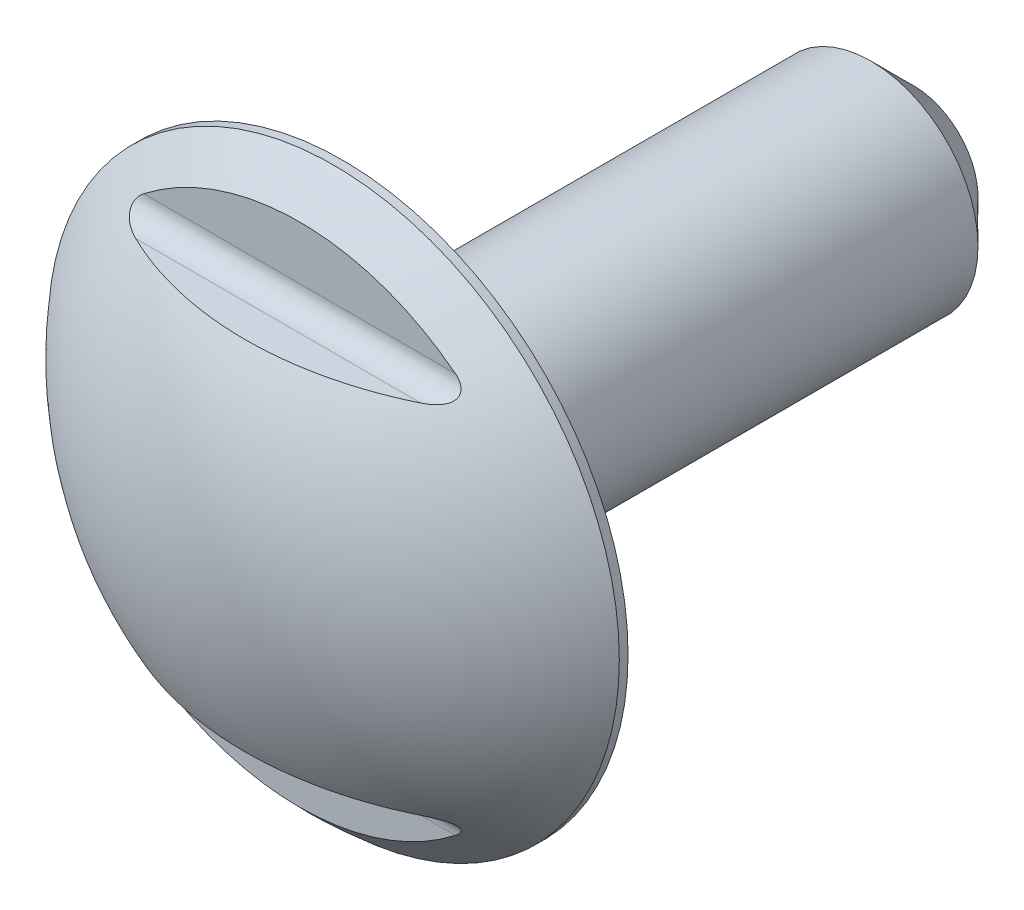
ISO-10303-21;
HEADER;
FILE_DESCRIPTION(('STEP AP214'),'2;1');
FILE_NAME('part.step','',(''),(''),'','','');
FILE_SCHEMA(('AUTOMOTIVE_DESIGN { 1 0 10303 214 1 1 1 1 }'));
ENDSEC;
DATA;
#1=APPLICATION_CONTEXT('core data for automotive mechanical design processes');
#2=APPLICATION_PROTOCOL_DEFINITION('international standard','automotive_design',2000,#1);
#3=PRODUCT_CONTEXT('',#1,'mechanical');
#4=PRODUCT('Part','Part','',(#3));
#5=PRODUCT_RELATED_PRODUCT_CATEGORY('part','',(#4));
#6=PRODUCT_DEFINITION_FORMATION('','',#4);
#7=PRODUCT_DEFINITION_CONTEXT('part definition',#1,'design');
#8=PRODUCT_DEFINITION('design','',#6,#7);
#9=PRODUCT_DEFINITION_SHAPE('','',#8);
#10=(LENGTH_UNIT() NAMED_UNIT(*) SI_UNIT(.MILLI.,.METRE.));
#11=(NAMED_UNIT(*) PLANE_ANGLE_UNIT() SI_UNIT($,.RADIAN.));
#12=(NAMED_UNIT(*) SI_UNIT($,.STERADIAN.) SOLID_ANGLE_UNIT());
#13=UNCERTAINTY_MEASURE_WITH_UNIT(LENGTH_MEASURE(1.E-05),#10,'distance_accuracy_value','');
#14=(GEOMETRIC_REPRESENTATION_CONTEXT(3) GLOBAL_UNCERTAINTY_ASSIGNED_CONTEXT((#13)) GLOBAL_UNIT_ASSIGNED_CONTEXT((#10,
#11,#12)) REPRESENTATION_CONTEXT('',''));
#15=CARTESIAN_POINT('',(0.,0.,0.));
#16=DIRECTION('',(0.,0.,1.));
#17=DIRECTION('',(1.,0.,0.));
#18=AXIS2_PLACEMENT_3D('',#15,#16,#17);
#19=CARTESIAN_POINT('',(0.,0.,-8.));
#20=DIRECTION('',(0.,0.,-1.));
#21=DIRECTION('',(1.,0.,0.));
#22=AXIS2_PLACEMENT_3D('',#19,#20,#21);
#23=CYLINDRICAL_SURFACE('',#22,4.);
#24=CARTESIAN_POINT('',(0.,0.,0.));
#25=DIRECTION('',(0.,0.,-1.));
#26=DIRECTION('',(1.,0.,0.));
#27=AXIS2_PLACEMENT_3D('',#24,#25,#26);
#28=CIRCLE('',#27,4.);
#29=CARTESIAN_POINT('',(4.,0.,0.));
#30=VERTEX_POINT('',#29);
#31=EDGE_CURVE('E147',#30,#30,#28,.T.);
#32=ORIENTED_EDGE('',*,*,#31,.F.);
#33=EDGE_LOOP('',(#32));
#34=FACE_BOUND('',#33,.T.);
#35=CARTESIAN_POINT('',(0.,0.,0.12264954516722));
#36=DIRECTION('',(0.,0.,1.));
#37=DIRECTION('',(-1.,0.,0.));
#38=AXIS2_PLACEMENT_3D('',#35,#36,#37);
#39=CIRCLE('',#38,4.);
#40=CARTESIAN_POINT('',(-4.,0.,0.12264954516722));
#41=VERTEX_POINT('',#40);
#42=EDGE_CURVE('E129',#41,#41,#39,.T.);
#43=ORIENTED_EDGE('',*,*,#42,.F.);
#44=EDGE_LOOP('',(#43));
#45=FACE_BOUND('',#44,.T.);
#46=ADVANCED_FACE('F14',(#34,#45),#23,.T.);
#47=CARTESIAN_POINT('',(0.,-4.,0.));
#48=DIRECTION('',(0.,0.,1.));
#49=DIRECTION('',(-1.,0.,0.));
#50=AXIS2_PLACEMENT_3D('',#47,#48,#49);
#51=PLANE('',#50);
#52=CARTESIAN_POINT('',(0.,0.,0.));
#53=DIRECTION('',(0.,0.,-1.));
#54=DIRECTION('',(1.,0.,0.));
#55=AXIS2_PLACEMENT_3D('',#52,#53,#54);
#56=CIRCLE('',#55,1.3);
#57=CARTESIAN_POINT('',(1.3,0.,0.));
#58=VERTEX_POINT('',#57);
#59=EDGE_CURVE('E144',#58,#58,#56,.T.);
#60=ORIENTED_EDGE('',*,*,#59,.F.);
#61=EDGE_LOOP('',(#60));
#62=FACE_BOUND('',#61,.T.);
#63=ORIENTED_EDGE('',*,*,#31,.T.);
#64=EDGE_LOOP('',(#63));
#65=FACE_BOUND('',#64,.T.);
#66=ADVANCED_FACE('F171',(#62,#65),#51,.F.);
#67=CARTESIAN_POINT('',(0.,0.,-0.2));
#68=DIRECTION('',(0.,0.,-1.));
#69=DIRECTION('',(1.,0.,0.));
#70=AXIS2_PLACEMENT_3D('',#67,#68,#69);
#71=TOROIDAL_SURFACE('',#70,1.3,0.2);
#72=CARTESIAN_POINT('',(0.,0.,-0.2));
#73=DIRECTION('',(0.,0.,-1.));
#74=DIRECTION('',(1.,0.,0.));
#75=AXIS2_PLACEMENT_3D('',#72,#73,#74);
#76=CIRCLE('',#75,1.1);
#77=CARTESIAN_POINT('',(1.1,0.,-0.2));
#78=VERTEX_POINT('',#77);
#79=EDGE_CURVE('E141',#78,#78,#76,.T.);
#80=ORIENTED_EDGE('',*,*,#79,.F.);
#81=EDGE_LOOP('',(#80));
#82=FACE_BOUND('',#81,.T.);
#83=ORIENTED_EDGE('',*,*,#59,.T.);
#84=EDGE_LOOP('',(#83));
#85=FACE_BOUND('',#84,.T.);
#86=ADVANCED_FACE('F176',(#82,#85),#71,.F.);
#87=CARTESIAN_POINT('',(0.,0.,-8.));
#88=DIRECTION('',(0.,0.,-1.));
#89=DIRECTION('',(1.,0.,0.));
#90=AXIS2_PLACEMENT_3D('',#87,#88,#89);
#91=CYLINDRICAL_SURFACE('',#90,1.1);
#92=CARTESIAN_POINT('',(0.,0.,-0.353589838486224));
#93=DIRECTION('',(0.,0.,-1.));
#94=DIRECTION('',(1.,0.,0.));
#95=AXIS2_PLACEMENT_3D('',#92,#93,#94);
#96=CIRCLE('',#95,1.1);
#97=CARTESIAN_POINT('',(1.1,0.,-0.353589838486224));
#98=VERTEX_POINT('',#97);
#99=EDGE_CURVE('E138',#98,#98,#96,.T.);
#100=ORIENTED_EDGE('',*,*,#99,.F.);
#101=EDGE_LOOP('',(#100));
#102=FACE_BOUND('',#101,.T.);
#103=ORIENTED_EDGE('',*,*,#79,.T.);
#104=EDGE_LOOP('',(#103));
#105=FACE_BOUND('',#104,.T.);
#106=ADVANCED_FACE('F184',(#102,#105),#91,.T.);
#107=CARTESIAN_POINT('',(0.,0.,-0.353589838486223));
#108=DIRECTION('',(0.,0.,-1.));
#109=DIRECTION('',(1.,0.,0.));
#110=AXIS2_PLACEMENT_3D('',#107,#108,#109);
#111=TOROIDAL_SURFACE('',#110,1.3,0.200000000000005);
#112=CARTESIAN_POINT('',(0.,0.,-0.453589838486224));
#113=DIRECTION('',(0.,0.,-1.));
#114=DIRECTION('',(1.,0.,0.));
#115=AXIS2_PLACEMENT_3D('',#112,#113,#114);
#116=CIRCLE('',#115,1.12679491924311);
#117=CARTESIAN_POINT('',(1.12679491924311,0.,-0.453589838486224));
#118=VERTEX_POINT('',#117);
#119=EDGE_CURVE('E135',#118,#118,#116,.T.);
#120=ORIENTED_EDGE('',*,*,#119,.F.);
#121=EDGE_LOOP('',(#120));
#122=FACE_BOUND('',#121,.T.);
#123=ORIENTED_EDGE('',*,*,#99,.T.);
#124=EDGE_LOOP('',(#123));
#125=FACE_BOUND('',#124,.T.);
#126=ADVANCED_FACE('F188',(#122,#125),#111,.F.);
#127=CARTESIAN_POINT('',(0.,0.,-0.453589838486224));
#128=DIRECTION('',(0.,0.,-1.));
#129=DIRECTION('',(1.,0.,0.));
#130=AXIS2_PLACEMENT_3D('',#127,#128,#129);
#131=CONICAL_SURFACE('',#130,1.12679491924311,0.523598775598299);
#132=CARTESIAN_POINT('',(0.,0.,-1.1));
#133=DIRECTION('',(0.,0.,-1.));
#134=DIRECTION('',(1.,0.,0.));
#135=AXIS2_PLACEMENT_3D('',#132,#133,#134);
#136=CIRCLE('',#135,1.5);
#137=CARTESIAN_POINT('',(1.5,0.,-1.1));
#138=VERTEX_POINT('',#137);
#139=EDGE_CURVE('E132',#138,#138,#136,.T.);
#140=ORIENTED_EDGE('',*,*,#139,.F.);
#141=EDGE_LOOP('',(#140));
#142=FACE_BOUND('',#141,.T.);
#143=ORIENTED_EDGE('',*,*,#119,.T.);
#144=EDGE_LOOP('',(#143));
#145=FACE_BOUND('',#144,.T.);
#146=ADVANCED_FACE('F168',(#142,#145),#131,.T.);
#147=CARTESIAN_POINT('',(0.,0.,-8.));
#148=DIRECTION('',(0.,0.,-1.));
#149=DIRECTION('',(1.,0.,0.));
#150=AXIS2_PLACEMENT_3D('',#147,#148,#149);
#151=CYLINDRICAL_SURFACE('',#150,1.5);
#152=CARTESIAN_POINT('',(0.,0.,-7.4));
#153=DIRECTION('',(0.,0.,1.));
#154=DIRECTION('',(-1.,0.,0.));
#155=AXIS2_PLACEMENT_3D('',#152,#153,#154);
#156=CIRCLE('',#155,1.5);
#157=CARTESIAN_POINT('',(-1.5,0.,-7.4));
#158=VERTEX_POINT('',#157);
#159=EDGE_CURVE('E58',#158,#158,#156,.T.);
#160=ORIENTED_EDGE('',*,*,#159,.T.);
#161=EDGE_LOOP('',(#160));
#162=FACE_BOUND('',#161,.T.);
#163=ORIENTED_EDGE('',*,*,#139,.T.);
#164=EDGE_LOOP('',(#163));
#165=FACE_BOUND('',#164,.T.);
#166=ADVANCED_FACE('F155',(#162,#165),#151,.T.);
#167=CARTESIAN_POINT('',(0.,-1.1935,-8.));
#168=DIRECTION('',(0.,0.,1.));
#169=DIRECTION('',(-1.,0.,0.));
#170=AXIS2_PLACEMENT_3D('',#167,#168,#169);
#171=PLANE('',#170);
#172=CARTESIAN_POINT('',(0.,0.,-8.));
#173=DIRECTION('',(0.,0.,1.));
#174=DIRECTION('',(-1.,0.,0.));
#175=AXIS2_PLACEMENT_3D('',#172,#173,#174);
#176=CIRCLE('',#175,0.9);
#177=CARTESIAN_POINT('',(-0.9,0.,-8.));
#178=VERTEX_POINT('',#177);
#179=EDGE_CURVE('E150',#178,#178,#176,.F.);
#180=ORIENTED_EDGE('',*,*,#179,.T.);
#181=EDGE_LOOP('',(#180));
#182=FACE_BOUND('',#181,.T.);
#183=ADVANCED_FACE('F160',(#182),#171,.F.);
#184=CARTESIAN_POINT('',(0.,0.,-8.));
#185=DIRECTION('',(0.,0.,1.));
#186=DIRECTION('',(-1.,0.,0.));
#187=AXIS2_PLACEMENT_3D('',#184,#185,#186);
#188=CONICAL_SURFACE('',#187,0.9,0.785398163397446);
#189=ORIENTED_EDGE('',*,*,#159,.F.);
#190=EDGE_LOOP('',(#189));
#191=FACE_BOUND('',#190,.T.);
#192=ORIENTED_EDGE('',*,*,#179,.F.);
#193=EDGE_LOOP('',(#192));
#194=FACE_BOUND('',#193,.T.);
#195=ADVANCED_FACE('F16',(#191,#194),#188,.T.);
#196=CARTESIAN_POINT('',(0.,0.,-3.2));
#197=DIRECTION('',(0.,0.,1.));
#198=DIRECTION('',(0.,-1.,0.));
#199=AXIS2_PLACEMENT_3D('',#196,#197,#198);
#200=SPHERICAL_SURFACE('',#199,5.2);
#201=CARTESIAN_POINT('',(0.,2.5,-3.2));
#202=DIRECTION('',(0.,-1.,0.));
#203=DIRECTION('',(1.,0.,0.));
#204=AXIS2_PLACEMENT_3D('',#201,#202,#203);
#205=CIRCLE('',#204,4.5596052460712);
#206=CARTESIAN_POINT('',(-1.99499373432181,2.5,0.9));
#207=VERTEX_POINT('',#206);
#208=CARTESIAN_POINT('',(1.994993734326,2.5,0.9));
#209=VERTEX_POINT('',#208);
#210=EDGE_CURVE('E9',#207,#209,#205,.F.);
#211=ORIENTED_EDGE('',*,*,#210,.F.);
#212=CARTESIAN_POINT('',(-2.18148560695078,2.8002,0.600000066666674));
#213=CARTESIAN_POINT('',(-2.19362930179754,2.7907147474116,0.600019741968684));
#214=CARTESIAN_POINT('',(-2.20552699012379,2.78074549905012,0.600440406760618));
#215=CARTESIAN_POINT('',(-2.22841120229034,2.75955495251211,0.602536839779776));
#216=CARTESIAN_POINT('',(-2.23937741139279,2.7483143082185,0.604235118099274));
#217=CARTESIAN_POINT('',(-2.25595559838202,2.72879878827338,0.608467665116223));
#218=CARTESIAN_POINT('',(-2.26209375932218,2.72087219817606,0.610497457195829));
#219=CARTESIAN_POINT('',(-2.27325803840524,2.70456948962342,0.61545602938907));
#220=CARTESIAN_POINT('',(-2.27828965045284,2.69619586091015,0.618380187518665));
#221=CARTESIAN_POINT('',(-2.28588020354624,2.68105068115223,0.624497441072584));
#222=CARTESIAN_POINT('',(-2.28874117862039,2.67434707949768,0.627478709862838));
#223=CARTESIAN_POINT('',(-2.29334802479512,2.66087716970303,0.634103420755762));
#224=CARTESIAN_POINT('',(-2.29509452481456,2.6541108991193,0.637746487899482));
#225=CARTESIAN_POINT('',(-2.29730461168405,2.64068344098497,0.645678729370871));
#226=CARTESIAN_POINT('',(-2.29775998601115,2.63402319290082,0.649971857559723));
#227=CARTESIAN_POINT('',(-2.29731000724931,2.6210966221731,0.659051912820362));
#228=CARTESIAN_POINT('',(-2.29640447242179,2.61483035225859,0.663838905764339));
#229=CARTESIAN_POINT('',(-2.29348190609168,2.60344375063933,0.673250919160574));
#230=CARTESIAN_POINT('',(-2.29157722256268,2.59827106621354,0.677848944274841));
#231=CARTESIAN_POINT('',(-2.28688710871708,2.58846666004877,0.68716336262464));
#232=CARTESIAN_POINT('',(-2.28410141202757,2.58383510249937,0.691879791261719));
#233=CARTESIAN_POINT('',(-2.2759175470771,2.57248877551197,0.704181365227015));
#234=CARTESIAN_POINT('',(-2.26995648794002,2.56619967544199,0.71178320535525));
#235=CARTESIAN_POINT('',(-2.25676803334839,2.55486022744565,0.726807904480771));
#236=CARTESIAN_POINT('',(-2.24953697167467,2.54981357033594,0.734230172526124));
#237=CARTESIAN_POINT('',(-2.228331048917,2.53726193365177,0.754396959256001));
#238=CARTESIAN_POINT('',(-2.21344357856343,2.53084751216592,0.766848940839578));
#239=CARTESIAN_POINT('',(-2.18216661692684,2.52025272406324,0.790851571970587));
#240=CARTESIAN_POINT('',(-2.16576887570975,2.51608559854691,0.802396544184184));
#241=CARTESIAN_POINT('',(-2.12425701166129,2.50783454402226,0.829788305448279));
#242=CARTESIAN_POINT('',(-2.09863400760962,2.50468951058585,0.845140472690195));
#243=CARTESIAN_POINT('',(-2.05972898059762,2.50175690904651,0.866810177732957));
#244=CARTESIAN_POINT('',(-2.0468228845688,2.50107500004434,0.873739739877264));
#245=CARTESIAN_POINT('',(-2.02083255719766,2.50019563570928,0.88723270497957));
#246=CARTESIAN_POINT('',(-2.00774867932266,2.49999732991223,0.893796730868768));
#247=CARTESIAN_POINT('',(-1.99458256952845,2.50000006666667,0.900199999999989));
#248=B_SPLINE_CURVE_WITH_KNOTS('',3,(#212,#213,#214,#215,#216,#217,#218,#219,#220,#221,#222,
#223,#224,#225,#226,#227,#228,#229,#230,#231,#232,#233,#234,#235,#236,#237,#238,#239,#240,#241,
#242,#243,#244,#245,#246,#247),.UNSPECIFIED.,.F.,.F.,(4,2,2,2,2,2,2,2,2,2,2,2,2,2,2,2,2,4),(0.,
0.0463823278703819,0.0936015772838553,0.124204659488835,0.154652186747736,0.17818623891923,
0.201706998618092,0.225377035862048,0.249050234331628,0.270500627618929,0.291957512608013,
0.326339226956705,0.360821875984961,0.421799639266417,0.483132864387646,0.572973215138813,
0.61696059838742,0.660870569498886),.UNSPECIFIED.);
#249=CARTESIAN_POINT('',(-2.18174242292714,2.8,0.6));
#250=VERTEX_POINT('',#249);
#251=EDGE_CURVE('E108',#250,#207,#248,.T.);
#252=ORIENTED_EDGE('',*,*,#251,.F.);
#253=CARTESIAN_POINT('',(0.,0.,0.6));
#254=DIRECTION('',(0.,0.,-1.));
#255=DIRECTION('',(0.,-1.,0.));
#256=AXIS2_PLACEMENT_3D('',#253,#254,#255);
#257=CIRCLE('',#256,3.54964786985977);
#258=CARTESIAN_POINT('',(2.18174242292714,2.8,0.6));
#259=VERTEX_POINT('',#258);
#260=EDGE_CURVE('E121',#259,#250,#257,.F.);
#261=ORIENTED_EDGE('',*,*,#260,.F.);
#262=CARTESIAN_POINT('',(1.99458256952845,2.50000006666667,0.900199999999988));
#263=CARTESIAN_POINT('',(2.00924618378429,2.5000008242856,0.89306640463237));
#264=CARTESIAN_POINT('',(2.02381938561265,2.50024530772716,0.88573062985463));
#265=CARTESIAN_POINT('',(2.05275138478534,2.50134632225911,0.870595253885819));
#266=CARTESIAN_POINT('',(2.06710944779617,2.50220460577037,0.862794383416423));
#267=CARTESIAN_POINT('',(2.09559928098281,2.50466845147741,0.846649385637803));
#268=CARTESIAN_POINT('',(2.10972854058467,2.50627957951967,0.838301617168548));
#269=CARTESIAN_POINT('',(2.13750512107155,2.51043126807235,0.821079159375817));
#270=CARTESIAN_POINT('',(2.15115302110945,2.51297066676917,0.812205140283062));
#271=CARTESIAN_POINT('',(2.17627000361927,2.51887670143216,0.794912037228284));
#272=CARTESIAN_POINT('',(2.18781075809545,2.52211702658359,0.786555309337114));
#273=CARTESIAN_POINT('',(2.21014903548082,2.52978442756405,0.769338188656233));
#274=CARTESIAN_POINT('',(2.22094523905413,2.53421354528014,0.760476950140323));
#275=CARTESIAN_POINT('',(2.24153862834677,2.54467843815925,0.742123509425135));
#276=CARTESIAN_POINT('',(2.2513161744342,2.55073975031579,0.73262325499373));
#277=CARTESIAN_POINT('',(2.26886803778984,2.56488191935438,0.713289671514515));
#278=CARTESIAN_POINT('',(2.27665487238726,2.5729494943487,0.70345888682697));
#279=CARTESIAN_POINT('',(2.28604704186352,2.58697138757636,0.688653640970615));
#280=CARTESIAN_POINT('',(2.2888237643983,2.59207417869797,0.68361895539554));
#281=CARTESIAN_POINT('',(2.29331344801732,2.60288770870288,0.673725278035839));
#282=CARTESIAN_POINT('',(2.29502729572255,2.60859793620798,0.668866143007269));
#283=CARTESIAN_POINT('',(2.29723548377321,2.62055773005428,0.6594618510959));
#284=CARTESIAN_POINT('',(2.29772227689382,2.62681039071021,0.654918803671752));
#285=CARTESIAN_POINT('',(2.29739959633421,2.6396274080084,0.64634653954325));
#286=CARTESIAN_POINT('',(2.29658995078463,2.64619180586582,0.642317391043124));
#287=CARTESIAN_POINT('',(2.29386629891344,2.65892418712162,0.635146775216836));
#288=CARTESIAN_POINT('',(2.29203628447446,2.66508655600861,0.631962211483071));
#289=CARTESIAN_POINT('',(2.28748498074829,2.67733185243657,0.626141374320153));
#290=CARTESIAN_POINT('',(2.28476373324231,2.6834147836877,0.623505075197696));
#291=CARTESIAN_POINT('',(2.27680636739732,2.69887909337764,0.617372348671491));
#292=CARTESIAN_POINT('',(2.27102624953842,2.70813198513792,0.614261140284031));
#293=CARTESIAN_POINT('',(2.25818412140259,2.72607760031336,0.609098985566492));
#294=CARTESIAN_POINT('',(2.25111402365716,2.73476629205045,0.607055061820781));
#295=CARTESIAN_POINT('',(2.23421100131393,2.75365124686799,0.603407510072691));
#296=CARTESIAN_POINT('',(2.2241325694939,2.76366946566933,0.602047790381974));
#297=CARTESIAN_POINT('',(2.20326210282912,2.78264375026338,0.600358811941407));
#298=CARTESIAN_POINT('',(2.19248616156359,2.79161567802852,0.600011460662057));
#299=CARTESIAN_POINT('',(2.18148560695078,2.8002,0.600000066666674));
#300=B_SPLINE_CURVE_WITH_KNOTS('',3,(#262,#263,#264,#265,#266,#267,#268,#269,#270,#271,#272,
#273,#274,#275,#276,#277,#278,#279,#280,#281,#282,#283,#284,#285,#286,#287,#288,#289,#290,#291,
#292,#293,#294,#295,#296,#297,#298,#299),.UNSPECIFIED.,.F.,.F.,(4,2,2,2,2,2,2,2,2,2,2,2,2,2,2,2,
2,2,4),(0.,0.0489276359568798,0.0979955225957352,0.147432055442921,0.196806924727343,
0.240588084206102,0.284444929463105,0.329032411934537,0.373332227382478,0.396312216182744,
0.419273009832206,0.442374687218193,0.465479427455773,0.486915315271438,0.508350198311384,
0.542190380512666,0.576250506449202,0.618966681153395,0.660914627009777),.UNSPECIFIED.);
#301=EDGE_CURVE('E22',#209,#259,#300,.T.);
#302=ORIENTED_EDGE('',*,*,#301,.F.);
#303=EDGE_LOOP('',(#211,#252,#261,#302));
#304=FACE_BOUND('',#303,.T.);
#305=CARTESIAN_POINT('',(0.,-2.5,-3.2));
#306=DIRECTION('',(0.,1.,0.));
#307=DIRECTION('',(-1.,0.,0.));
#308=AXIS2_PLACEMENT_3D('',#305,#306,#307);
#309=CIRCLE('',#308,4.55960524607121);
#310=CARTESIAN_POINT('',(1.99499373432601,-2.5,0.9));
#311=VERTEX_POINT('',#310);
#312=CARTESIAN_POINT('',(-1.99499373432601,-2.5,0.9));
#313=VERTEX_POINT('',#312);
#314=EDGE_CURVE('E70',#311,#313,#309,.F.);
#315=ORIENTED_EDGE('',*,*,#314,.F.);
#316=CARTESIAN_POINT('',(2.1814856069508,-2.8002,0.600000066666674));
#317=CARTESIAN_POINT('',(2.19362930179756,-2.7907147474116,0.600019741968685));
#318=CARTESIAN_POINT('',(2.20552699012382,-2.78074549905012,0.600440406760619));
#319=CARTESIAN_POINT('',(2.22841120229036,-2.75955495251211,0.602536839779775));
#320=CARTESIAN_POINT('',(2.23937741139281,-2.74831430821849,0.604235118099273));
#321=CARTESIAN_POINT('',(2.25595559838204,-2.72879878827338,0.608467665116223));
#322=CARTESIAN_POINT('',(2.2620937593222,-2.72087219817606,0.610497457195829));
#323=CARTESIAN_POINT('',(2.27325803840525,-2.70456948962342,0.61545602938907));
#324=CARTESIAN_POINT('',(2.27828965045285,-2.69619586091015,0.618380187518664));
#325=CARTESIAN_POINT('',(2.28588020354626,-2.68105068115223,0.624497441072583));
#326=CARTESIAN_POINT('',(2.28874117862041,-2.67434707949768,0.627478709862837));
#327=CARTESIAN_POINT('',(2.29334802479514,-2.66087716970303,0.634103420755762));
#328=CARTESIAN_POINT('',(2.29509452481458,-2.6541108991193,0.637746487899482));
#329=CARTESIAN_POINT('',(2.29730461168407,-2.64068344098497,0.645678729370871));
#330=CARTESIAN_POINT('',(2.29775998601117,-2.63402319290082,0.649971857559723));
#331=CARTESIAN_POINT('',(2.29731000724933,-2.62109662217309,0.659051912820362));
#332=CARTESIAN_POINT('',(2.29640447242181,-2.61483035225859,0.663838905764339));
#333=CARTESIAN_POINT('',(2.2934819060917,-2.60344375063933,0.673250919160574));
#334=CARTESIAN_POINT('',(2.2915772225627,-2.59827106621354,0.677848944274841));
#335=CARTESIAN_POINT('',(2.28688710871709,-2.58846666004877,0.68716336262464));
#336=CARTESIAN_POINT('',(2.28410141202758,-2.58383510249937,0.691879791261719));
#337=CARTESIAN_POINT('',(2.27591754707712,-2.57248877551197,0.704181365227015));
#338=CARTESIAN_POINT('',(2.26995648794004,-2.56619967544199,0.711783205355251));
#339=CARTESIAN_POINT('',(2.25676803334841,-2.55486022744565,0.726807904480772));
#340=CARTESIAN_POINT('',(2.24953697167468,-2.54981357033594,0.734230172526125));
#341=CARTESIAN_POINT('',(2.22833104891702,-2.53726193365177,0.754396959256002));
#342=CARTESIAN_POINT('',(2.21344357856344,-2.53084751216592,0.76684894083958));
#343=CARTESIAN_POINT('',(2.18216661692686,-2.52025272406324,0.79085157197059));
#344=CARTESIAN_POINT('',(2.16576887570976,-2.5160855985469,0.802396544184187));
#345=CARTESIAN_POINT('',(2.12425701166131,-2.50783454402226,0.829788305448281));
#346=CARTESIAN_POINT('',(2.09863400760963,-2.50468951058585,0.845140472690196));
#347=CARTESIAN_POINT('',(2.05972898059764,-2.50175690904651,0.866810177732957));
#348=CARTESIAN_POINT('',(2.04682288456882,-2.50107500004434,0.873739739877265));
#349=CARTESIAN_POINT('',(2.02083255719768,-2.50019563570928,0.88723270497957));
#350=CARTESIAN_POINT('',(2.00774867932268,-2.49999732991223,0.893796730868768));
#351=CARTESIAN_POINT('',(1.99458256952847,-2.50000006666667,0.900199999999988));
#352=B_SPLINE_CURVE_WITH_KNOTS('',3,(#316,#317,#318,#319,#320,#321,#322,#323,#324,#325,#326,
#327,#328,#329,#330,#331,#332,#333,#334,#335,#336,#337,#338,#339,#340,#341,#342,#343,#344,#345,
#346,#347,#348,#349,#350,#351),.UNSPECIFIED.,.F.,.F.,(4,2,2,2,2,2,2,2,2,2,2,2,2,2,2,2,2,4),(0.,
0.0463823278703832,0.0936015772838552,0.124204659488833,0.154652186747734,0.178186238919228,
0.201706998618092,0.225377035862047,0.249050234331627,0.270500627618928,0.291957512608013,
0.326339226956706,0.360821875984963,0.421799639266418,0.483132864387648,0.572973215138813,
0.616960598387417,0.660870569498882),.UNSPECIFIED.);
#353=CARTESIAN_POINT('',(2.18174242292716,-2.8,0.6));
#354=VERTEX_POINT('',#353);
#355=EDGE_CURVE('E57',#354,#311,#352,.T.);
#356=ORIENTED_EDGE('',*,*,#355,.F.);
#357=CARTESIAN_POINT('',(0.,0.,0.6));
#358=DIRECTION('',(0.,0.,-1.));
#359=DIRECTION('',(0.,-1.,0.));
#360=AXIS2_PLACEMENT_3D('',#357,#358,#359);
#361=CIRCLE('',#360,3.54964786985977);
#362=CARTESIAN_POINT('',(-2.18174242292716,-2.8,0.6));
#363=VERTEX_POINT('',#362);
#364=EDGE_CURVE('E52',#363,#354,#361,.F.);
#365=ORIENTED_EDGE('',*,*,#364,.F.);
#366=CARTESIAN_POINT('',(-1.99458256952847,-2.50000006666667,0.900199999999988));
#367=CARTESIAN_POINT('',(-2.00924618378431,-2.5000008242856,0.89306640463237));
#368=CARTESIAN_POINT('',(-2.02381938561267,-2.50024530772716,0.88573062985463));
#369=CARTESIAN_POINT('',(-2.05275138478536,-2.50134632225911,0.870595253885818));
#370=CARTESIAN_POINT('',(-2.06710944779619,-2.50220460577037,0.862794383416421));
#371=CARTESIAN_POINT('',(-2.09559928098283,-2.50466845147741,0.846649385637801));
#372=CARTESIAN_POINT('',(-2.10972854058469,-2.50627957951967,0.838301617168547));
#373=CARTESIAN_POINT('',(-2.13750512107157,-2.51043126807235,0.821079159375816));
#374=CARTESIAN_POINT('',(-2.15115302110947,-2.51297066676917,0.812205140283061));
#375=CARTESIAN_POINT('',(-2.17627000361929,-2.51887670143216,0.794912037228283));
#376=CARTESIAN_POINT('',(-2.18781075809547,-2.52211702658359,0.786555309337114));
#377=CARTESIAN_POINT('',(-2.21014903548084,-2.52978442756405,0.769338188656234));
#378=CARTESIAN_POINT('',(-2.22094523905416,-2.53421354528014,0.760476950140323));
#379=CARTESIAN_POINT('',(-2.24153862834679,-2.54467843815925,0.742123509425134));
#380=CARTESIAN_POINT('',(-2.25131617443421,-2.55073975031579,0.732623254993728));
#381=CARTESIAN_POINT('',(-2.26886803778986,-2.56488191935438,0.713289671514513));
#382=CARTESIAN_POINT('',(-2.27665487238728,-2.5729494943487,0.703458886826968));
#383=CARTESIAN_POINT('',(-2.28604704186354,-2.58697138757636,0.688653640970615));
#384=CARTESIAN_POINT('',(-2.28882376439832,-2.59207417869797,0.683618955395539));
#385=CARTESIAN_POINT('',(-2.29331344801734,-2.60288770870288,0.673725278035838));
#386=CARTESIAN_POINT('',(-2.29502729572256,-2.60859793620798,0.668866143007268));
#387=CARTESIAN_POINT('',(-2.29723548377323,-2.62055773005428,0.659461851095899));
#388=CARTESIAN_POINT('',(-2.29772227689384,-2.62681039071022,0.654918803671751));
#389=CARTESIAN_POINT('',(-2.29739959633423,-2.6396274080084,0.646346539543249));
#390=CARTESIAN_POINT('',(-2.29658995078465,-2.64619180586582,0.642317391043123));
#391=CARTESIAN_POINT('',(-2.29386629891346,-2.65892418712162,0.635146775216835));
#392=CARTESIAN_POINT('',(-2.29203628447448,-2.66508655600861,0.631962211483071));
#393=CARTESIAN_POINT('',(-2.2874849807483,-2.67733185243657,0.626141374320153));
#394=CARTESIAN_POINT('',(-2.28476373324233,-2.6834147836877,0.623505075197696));
#395=CARTESIAN_POINT('',(-2.27680636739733,-2.69887909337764,0.61737234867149));
#396=CARTESIAN_POINT('',(-2.27102624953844,-2.70813198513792,0.61426114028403));
#397=CARTESIAN_POINT('',(-2.25818412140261,-2.72607760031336,0.609098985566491));
#398=CARTESIAN_POINT('',(-2.25111402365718,-2.73476629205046,0.60705506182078));
#399=CARTESIAN_POINT('',(-2.23421100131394,-2.75365124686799,0.60340751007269));
#400=CARTESIAN_POINT('',(-2.22413256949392,-2.76366946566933,0.602047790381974));
#401=CARTESIAN_POINT('',(-2.20326210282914,-2.78264375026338,0.600358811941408));
#402=CARTESIAN_POINT('',(-2.19248616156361,-2.79161567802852,0.600011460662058));
#403=CARTESIAN_POINT('',(-2.1814856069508,-2.8002,0.600000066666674));
#404=B_SPLINE_CURVE_WITH_KNOTS('',3,(#366,#367,#368,#369,#370,#371,#372,#373,#374,#375,#376,
#377,#378,#379,#380,#381,#382,#383,#384,#385,#386,#387,#388,#389,#390,#391,#392,#393,#394,#395,
#396,#397,#398,#399,#400,#401,#402,#403),.UNSPECIFIED.,.F.,.F.,(4,2,2,2,2,2,2,2,2,2,2,2,2,2,2,2,
2,2,4),(0.,0.0489276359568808,0.0979955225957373,0.147432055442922,0.196806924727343,
0.240588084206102,0.284444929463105,0.329032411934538,0.373332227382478,0.396312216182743,
0.419273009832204,0.442374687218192,0.465479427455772,0.486915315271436,0.508350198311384,
0.542190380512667,0.576250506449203,0.618966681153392,0.660914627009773),.UNSPECIFIED.);
#405=EDGE_CURVE('E64',#313,#363,#404,.T.);
#406=ORIENTED_EDGE('',*,*,#405,.F.);
#407=EDGE_LOOP('',(#315,#356,#365,#406));
#408=FACE_BOUND('',#407,.T.);
#409=ORIENTED_EDGE('',*,*,#42,.T.);
#410=EDGE_LOOP('',(#409));
#411=FACE_BOUND('',#410,.T.);
#412=ADVANCED_FACE('F68',(#304,#408,#411),#200,.T.);
#413=CARTESIAN_POINT('',(5.,-2.8,0.9));
#414=DIRECTION('',(-1.,0.,0.));
#415=DIRECTION('',(0.,-1.,0.));
#416=AXIS2_PLACEMENT_3D('',#413,#414,#415);
#417=CYLINDRICAL_SURFACE('',#416,0.3);
#418=ORIENTED_EDGE('',*,*,#405,.T.);
#419=DIRECTION('',(-1.,0.,0.));
#420=VECTOR('',#419,1.);
#421=CARTESIAN_POINT('',(5.,-2.8,0.6));
#422=LINE('',#421,#420);
#423=EDGE_CURVE('E35',#354,#363,#422,.T.);
#424=ORIENTED_EDGE('',*,*,#423,.F.);
#425=ORIENTED_EDGE('',*,*,#355,.T.);
#426=DIRECTION('',(-1.,0.,0.));
#427=VECTOR('',#426,1.);
#428=CARTESIAN_POINT('',(5.,-2.5,0.9));
#429=LINE('',#428,#427);
#430=EDGE_CURVE('E65',#311,#313,#429,.T.);
#431=ORIENTED_EDGE('',*,*,#430,.T.);
#432=EDGE_LOOP('',(#418,#424,#425,#431));
#433=FACE_BOUND('',#432,.T.);
#434=ADVANCED_FACE('F61',(#433),#417,.F.);
#435=CARTESIAN_POINT('',(5.,-2.5,1.91367347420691));
#436=DIRECTION('',(0.,1.,0.));
#437=DIRECTION('',(-1.,0.,0.));
#438=AXIS2_PLACEMENT_3D('',#435,#436,#437);
#439=PLANE('',#438);
#440=ORIENTED_EDGE('',*,*,#314,.T.);
#441=ORIENTED_EDGE('',*,*,#430,.F.);
#442=EDGE_LOOP('',(#440,#441));
#443=FACE_BOUND('',#442,.T.);
#444=ADVANCED_FACE('F90',(#443),#439,.F.);
#445=CARTESIAN_POINT('',(5.,-2.8,0.6));
#446=DIRECTION('',(0.,0.,-1.));
#447=DIRECTION('',(0.,-1.,0.));
#448=AXIS2_PLACEMENT_3D('',#445,#446,#447);
#449=PLANE('',#448);
#450=ORIENTED_EDGE('',*,*,#364,.T.);
#451=ORIENTED_EDGE('',*,*,#423,.T.);
#452=EDGE_LOOP('',(#450,#451));
#453=FACE_BOUND('',#452,.T.);
#454=ADVANCED_FACE('F53',(#453),#449,.F.);
#455=CARTESIAN_POINT('',(5.,2.5,1.91367347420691));
#456=DIRECTION('',(0.,-1.,0.));
#457=DIRECTION('',(1.,0.,0.));
#458=AXIS2_PLACEMENT_3D('',#455,#456,#457);
#459=PLANE('',#458);
#460=ORIENTED_EDGE('',*,*,#210,.T.);
#461=DIRECTION('',(-1.,0.,0.));
#462=VECTOR('',#461,1.);
#463=CARTESIAN_POINT('',(5.,2.5,0.9));
#464=LINE('',#463,#462);
#465=EDGE_CURVE('E125',#209,#207,#464,.T.);
#466=ORIENTED_EDGE('',*,*,#465,.T.);
#467=EDGE_LOOP('',(#460,#466));
#468=FACE_BOUND('',#467,.T.);
#469=ADVANCED_FACE('F94',(#468),#459,.F.);
#470=CARTESIAN_POINT('',(5.,2.8,0.9));
#471=DIRECTION('',(-1.,0.,0.));
#472=DIRECTION('',(0.,-1.,0.));
#473=AXIS2_PLACEMENT_3D('',#470,#471,#472);
#474=CYLINDRICAL_SURFACE('',#473,0.3);
#475=ORIENTED_EDGE('',*,*,#301,.T.);
#476=DIRECTION('',(-1.,0.,0.));
#477=VECTOR('',#476,1.);
#478=CARTESIAN_POINT('',(5.,2.8,0.6));
#479=LINE('',#478,#477);
#480=EDGE_CURVE('E28',#259,#250,#479,.T.);
#481=ORIENTED_EDGE('',*,*,#480,.T.);
#482=ORIENTED_EDGE('',*,*,#251,.T.);
#483=ORIENTED_EDGE('',*,*,#465,.F.);
#484=EDGE_LOOP('',(#475,#481,#482,#483));
#485=FACE_BOUND('',#484,.T.);
#486=ADVANCED_FACE('F101',(#485),#474,.F.);
#487=CARTESIAN_POINT('',(5.,2.8,0.6));
#488=DIRECTION('',(0.,0.,-1.));
#489=DIRECTION('',(0.,-1.,0.));
#490=AXIS2_PLACEMENT_3D('',#487,#488,#489);
#491=PLANE('',#490);
#492=ORIENTED_EDGE('',*,*,#260,.T.);
#493=ORIENTED_EDGE('',*,*,#480,.F.);
#494=EDGE_LOOP('',(#492,#493));
#495=FACE_BOUND('',#494,.T.);
#496=ADVANCED_FACE('F98',(#495),#491,.F.);
#497=CLOSED_SHELL('',(#46,#66,#86,#106,#126,#146,#166,#183,#195,#412,#434,#444,#454,#469,#486,#496));
#498=MANIFOLD_SOLID_BREP('B1',#497);
#499=ADVANCED_BREP_SHAPE_REPRESENTATION('',(#18,#498),#14);
#500=SHAPE_DEFINITION_REPRESENTATION(#9,#499);
ENDSEC;
END-ISO-10303-21;
